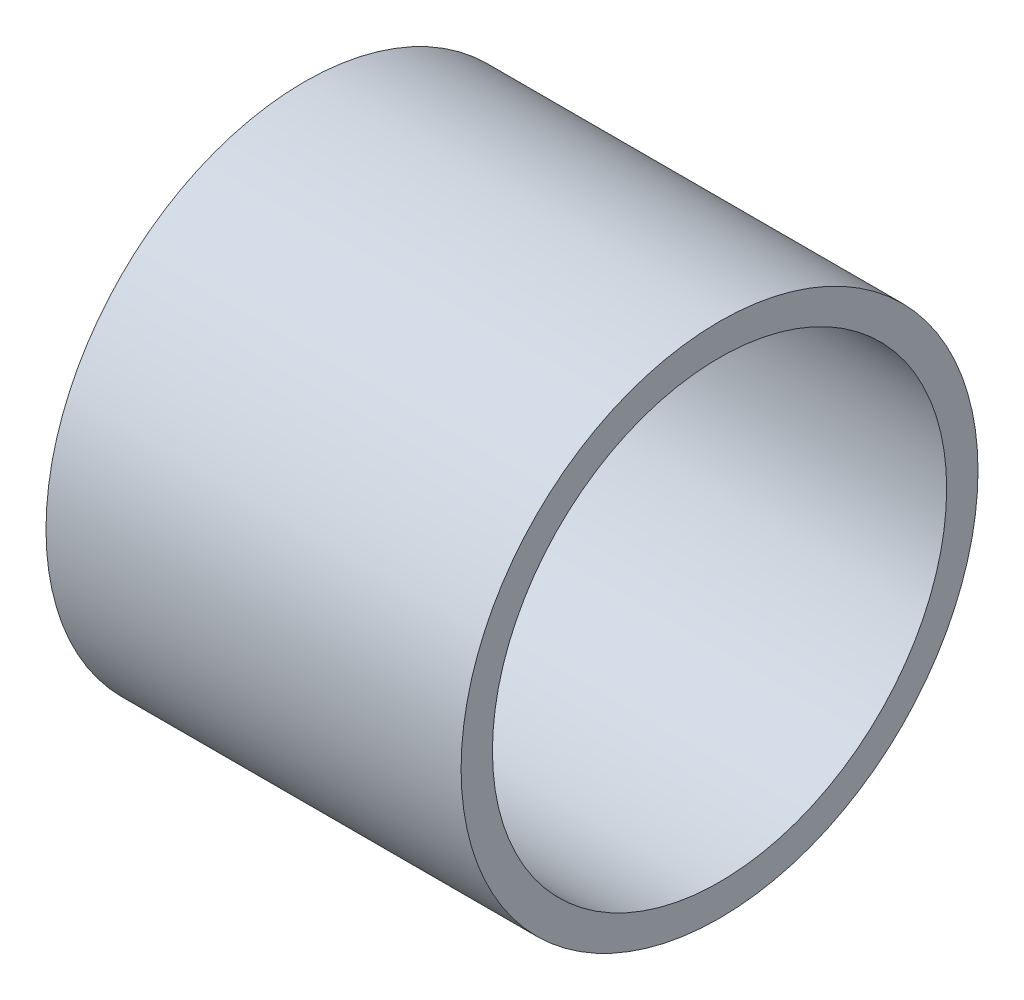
ISO-10303-21;
HEADER;
FILE_DESCRIPTION(('STEP AP214'),'2;1');
FILE_NAME('part.step','',(''),(''),'','','');
FILE_SCHEMA(('AUTOMOTIVE_DESIGN { 1 0 10303 214 1 1 1 1 }'));
ENDSEC;
DATA;
#1=APPLICATION_CONTEXT('core data for automotive mechanical design processes');
#2=APPLICATION_PROTOCOL_DEFINITION('international standard','automotive_design',2000,#1);
#3=PRODUCT_CONTEXT('',#1,'mechanical');
#4=PRODUCT('Part','Part','',(#3));
#5=PRODUCT_RELATED_PRODUCT_CATEGORY('part','',(#4));
#6=PRODUCT_DEFINITION_FORMATION('','',#4);
#7=PRODUCT_DEFINITION_CONTEXT('part definition',#1,'design');
#8=PRODUCT_DEFINITION('design','',#6,#7);
#9=PRODUCT_DEFINITION_SHAPE('','',#8);
#10=(LENGTH_UNIT() NAMED_UNIT(*) SI_UNIT(.MILLI.,.METRE.));
#11=(NAMED_UNIT(*) PLANE_ANGLE_UNIT() SI_UNIT($,.RADIAN.));
#12=(NAMED_UNIT(*) SI_UNIT($,.STERADIAN.) SOLID_ANGLE_UNIT());
#13=UNCERTAINTY_MEASURE_WITH_UNIT(LENGTH_MEASURE(1.E-05),#10,'distance_accuracy_value','');
#14=(GEOMETRIC_REPRESENTATION_CONTEXT(3) GLOBAL_UNCERTAINTY_ASSIGNED_CONTEXT((#13)) GLOBAL_UNIT_ASSIGNED_CONTEXT((#10,
#11,#12)) REPRESENTATION_CONTEXT('',''));
#15=CARTESIAN_POINT('',(0.,0.,0.));
#16=DIRECTION('',(0.,0.,1.));
#17=DIRECTION('',(1.,0.,0.));
#18=AXIS2_PLACEMENT_3D('',#15,#16,#17);
#19=CARTESIAN_POINT('',(0.,33.,0.));
#20=DIRECTION('',(1.,0.,0.));
#21=DIRECTION('',(0.,0.,-1.));
#22=AXIS2_PLACEMENT_3D('',#19,#20,#21);
#23=PLANE('',#22);
#24=CARTESIAN_POINT('',(0.,0.,0.));
#25=DIRECTION('',(-1.,0.,0.));
#26=DIRECTION('',(0.,0.,1.));
#27=AXIS2_PLACEMENT_3D('',#24,#25,#26);
#28=CIRCLE('',#27,29.);
#29=CARTESIAN_POINT('',(0.,0.,29.));
#30=VERTEX_POINT('',#29);
#31=EDGE_CURVE('E10',#30,#30,#28,.T.);
#32=ORIENTED_EDGE('',*,*,#31,.F.);
#33=EDGE_LOOP('',(#32));
#34=FACE_BOUND('',#33,.T.);
#35=CARTESIAN_POINT('',(0.,0.,0.));
#36=DIRECTION('',(-1.,0.,0.));
#37=DIRECTION('',(0.,0.,1.));
#38=AXIS2_PLACEMENT_3D('',#35,#36,#37);
#39=CIRCLE('',#38,33.);
#40=CARTESIAN_POINT('',(0.,0.,33.));
#41=VERTEX_POINT('',#40);
#42=EDGE_CURVE('E43',#41,#41,#39,.T.);
#43=ORIENTED_EDGE('',*,*,#42,.T.);
#44=EDGE_LOOP('',(#43));
#45=FACE_BOUND('',#44,.T.);
#46=ADVANCED_FACE('F29',(#34,#45),#23,.F.);
#47=CARTESIAN_POINT('',(0.,0.,0.));
#48=DIRECTION('',(-1.,0.,0.));
#49=DIRECTION('',(0.,0.,1.));
#50=AXIS2_PLACEMENT_3D('',#47,#48,#49);
#51=CYLINDRICAL_SURFACE('',#50,29.);
#52=CARTESIAN_POINT('',(53.,0.,0.));
#53=DIRECTION('',(-1.,0.,0.));
#54=DIRECTION('',(0.,0.,1.));
#55=AXIS2_PLACEMENT_3D('',#52,#53,#54);
#56=CIRCLE('',#55,29.);
#57=CARTESIAN_POINT('',(53.,0.,29.));
#58=VERTEX_POINT('',#57);
#59=EDGE_CURVE('E35',#58,#58,#56,.T.);
#60=ORIENTED_EDGE('',*,*,#59,.F.);
#61=EDGE_LOOP('',(#60));
#62=FACE_BOUND('',#61,.T.);
#63=ORIENTED_EDGE('',*,*,#31,.T.);
#64=EDGE_LOOP('',(#63));
#65=FACE_BOUND('',#64,.T.);
#66=ADVANCED_FACE('F58',(#62,#65),#51,.F.);
#67=CARTESIAN_POINT('',(53.,33.,0.));
#68=DIRECTION('',(-1.,0.,0.));
#69=DIRECTION('',(0.,0.,1.));
#70=AXIS2_PLACEMENT_3D('',#67,#68,#69);
#71=PLANE('',#70);
#72=CARTESIAN_POINT('',(53.,0.,0.));
#73=DIRECTION('',(-1.,0.,0.));
#74=DIRECTION('',(0.,0.,1.));
#75=AXIS2_PLACEMENT_3D('',#72,#73,#74);
#76=CIRCLE('',#75,33.);
#77=CARTESIAN_POINT('',(53.,0.,33.));
#78=VERTEX_POINT('',#77);
#79=EDGE_CURVE('E39',#78,#78,#76,.T.);
#80=ORIENTED_EDGE('',*,*,#79,.F.);
#81=EDGE_LOOP('',(#80));
#82=FACE_BOUND('',#81,.T.);
#83=ORIENTED_EDGE('',*,*,#59,.T.);
#84=EDGE_LOOP('',(#83));
#85=FACE_BOUND('',#84,.T.);
#86=ADVANCED_FACE('F53',(#82,#85),#71,.F.);
#87=CARTESIAN_POINT('',(0.,0.,0.));
#88=DIRECTION('',(-1.,0.,0.));
#89=DIRECTION('',(0.,0.,1.));
#90=AXIS2_PLACEMENT_3D('',#87,#88,#89);
#91=CYLINDRICAL_SURFACE('',#90,33.);
#92=ORIENTED_EDGE('',*,*,#42,.F.);
#93=EDGE_LOOP('',(#92));
#94=FACE_BOUND('',#93,.T.);
#95=ORIENTED_EDGE('',*,*,#79,.T.);
#96=EDGE_LOOP('',(#95));
#97=FACE_BOUND('',#96,.T.);
#98=ADVANCED_FACE('F50',(#94,#97),#91,.T.);
#99=CLOSED_SHELL('',(#46,#66,#86,#98));
#100=MANIFOLD_SOLID_BREP('B2',#99);
#101=ADVANCED_BREP_SHAPE_REPRESENTATION('',(#18,#100),#14);
#102=SHAPE_DEFINITION_REPRESENTATION(#9,#101);
ENDSEC;
END-ISO-10303-21;
